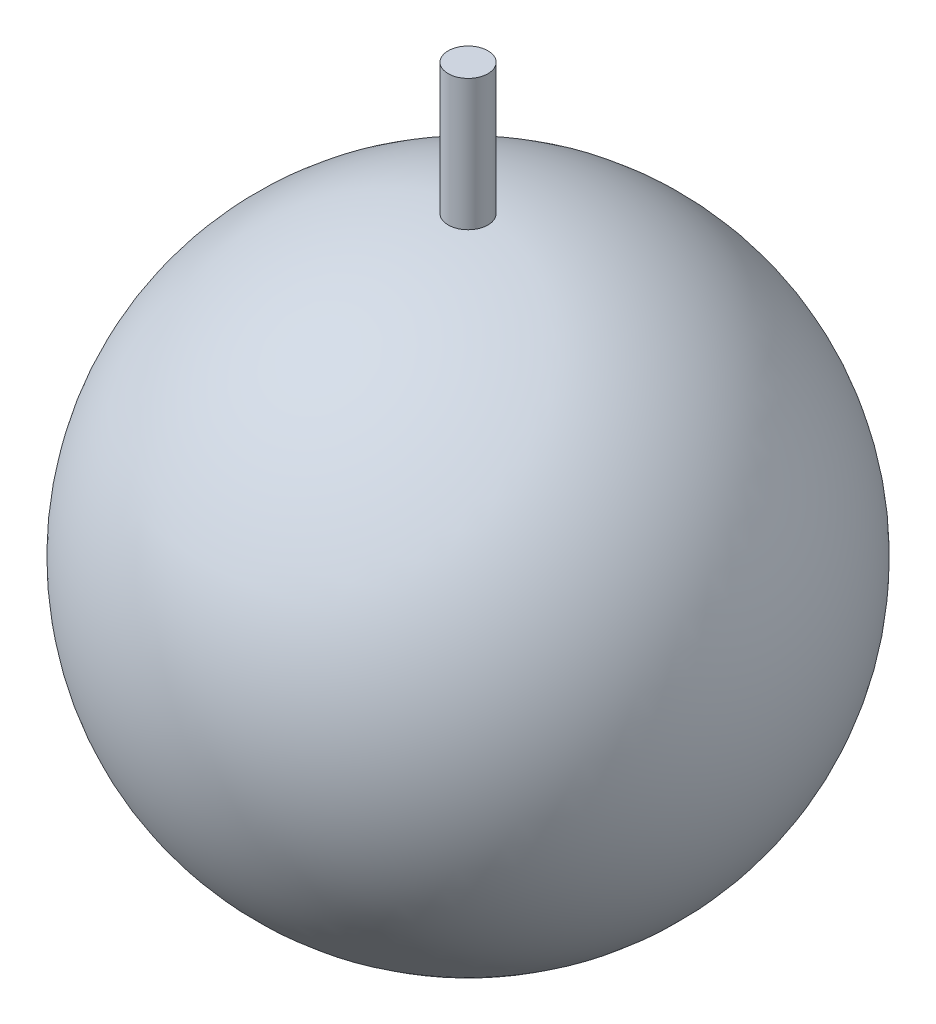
from build123d import *

# Parameters (mm, degrees)
ESQUISSE2_R        = 1.5
BOSS_EXTRU_1_DEPTH = 32.35


with BuildPart() as part:
    # Esquisse1 → R_volution1 (revolve)
    with BuildSketch(Plane.XY):
        with BuildLine():
            Line((-22.5, 0), (22.5, 0))
            ThreePointArc((22.5, 0), (0, 22.5), (-22.5, 0))
        make_face()
    revolve(axis=Axis((-22.5, 0, 0), (1, 0, 0)))

    # Esquisse2 → Boss.-Extru.1 (add)
    with BuildSketch(Plane.XZ):
        with Locations(Location((0, 0, 0), (0, 0, 270))):
            Circle(ESQUISSE2_R)
    extrude(amount=-BOSS_EXTRU_1_DEPTH)


solid = part.part
